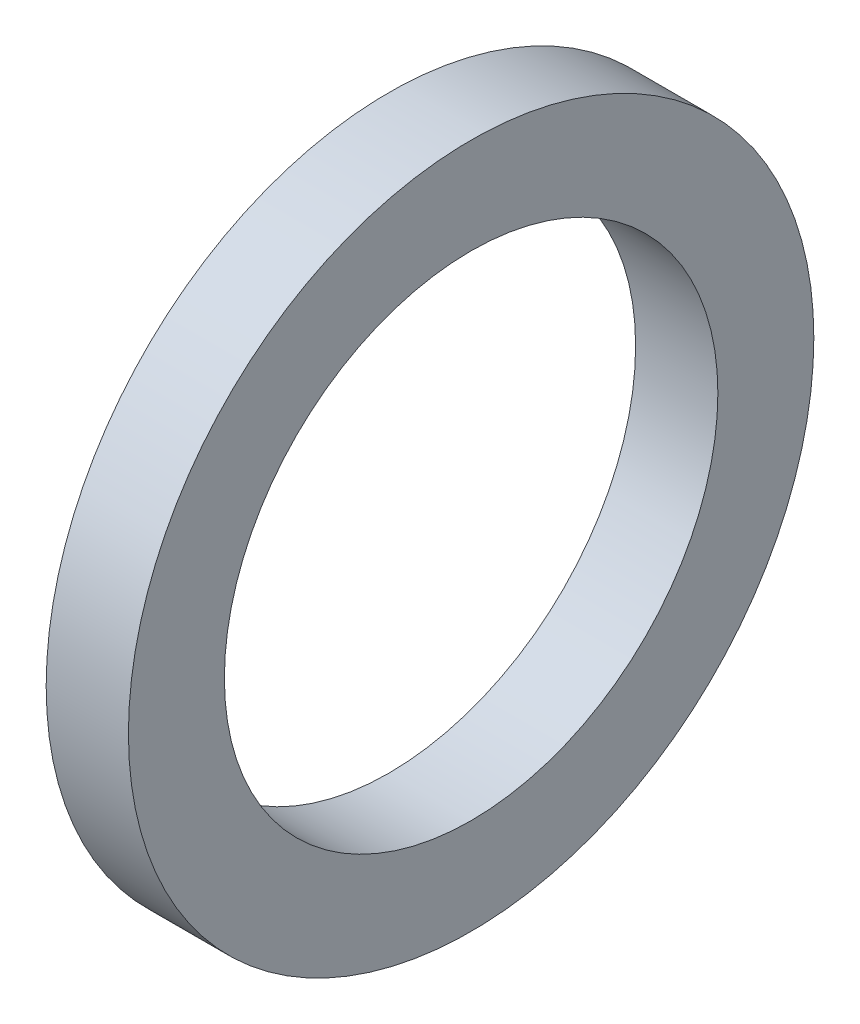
ISO-10303-21;
HEADER;
FILE_DESCRIPTION(('STEP AP214'),'2;1');
FILE_NAME('part.step','',(''),(''),'','','');
FILE_SCHEMA(('AUTOMOTIVE_DESIGN { 1 0 10303 214 1 1 1 1 }'));
ENDSEC;
DATA;
#1=APPLICATION_CONTEXT('core data for automotive mechanical design processes');
#2=APPLICATION_PROTOCOL_DEFINITION('international standard','automotive_design',2000,#1);
#3=PRODUCT_CONTEXT('',#1,'mechanical');
#4=PRODUCT('Part','Part','',(#3));
#5=PRODUCT_RELATED_PRODUCT_CATEGORY('part','',(#4));
#6=PRODUCT_DEFINITION_FORMATION('','',#4);
#7=PRODUCT_DEFINITION_CONTEXT('part definition',#1,'design');
#8=PRODUCT_DEFINITION('design','',#6,#7);
#9=PRODUCT_DEFINITION_SHAPE('','',#8);
#10=(LENGTH_UNIT() NAMED_UNIT(*) SI_UNIT(.MILLI.,.METRE.));
#11=(NAMED_UNIT(*) PLANE_ANGLE_UNIT() SI_UNIT($,.RADIAN.));
#12=(NAMED_UNIT(*) SI_UNIT($,.STERADIAN.) SOLID_ANGLE_UNIT());
#13=UNCERTAINTY_MEASURE_WITH_UNIT(LENGTH_MEASURE(1.E-05),#10,'distance_accuracy_value','');
#14=(GEOMETRIC_REPRESENTATION_CONTEXT(3) GLOBAL_UNCERTAINTY_ASSIGNED_CONTEXT((#13)) GLOBAL_UNIT_ASSIGNED_CONTEXT((#10,
#11,#12)) REPRESENTATION_CONTEXT('',''));
#15=CARTESIAN_POINT('',(0.,0.,0.));
#16=DIRECTION('',(0.,0.,1.));
#17=DIRECTION('',(1.,0.,0.));
#18=AXIS2_PLACEMENT_3D('',#15,#16,#17);
#19=CARTESIAN_POINT('',(-34.9249999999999,0.,0.));
#20=DIRECTION('',(-1.,0.,0.));
#21=DIRECTION('',(0.,0.,1.));
#22=AXIS2_PLACEMENT_3D('',#19,#20,#21);
#23=CYLINDRICAL_SURFACE('',#22,18.);
#24=CARTESIAN_POINT('',(0.,0.,0.));
#25=DIRECTION('',(-1.,0.,0.));
#26=DIRECTION('',(0.,0.,1.));
#27=AXIS2_PLACEMENT_3D('',#24,#25,#26);
#28=CIRCLE('',#27,18.);
#29=CARTESIAN_POINT('',(0.,0.,18.));
#30=VERTEX_POINT('',#29);
#31=EDGE_CURVE('E10',#30,#30,#28,.T.);
#32=ORIENTED_EDGE('',*,*,#31,.F.);
#33=EDGE_LOOP('',(#32));
#34=FACE_BOUND('',#33,.T.);
#35=CARTESIAN_POINT('',(-6.,0.,0.));
#36=DIRECTION('',(-1.,0.,0.));
#37=DIRECTION('',(0.,0.,1.));
#38=AXIS2_PLACEMENT_3D('',#35,#36,#37);
#39=CIRCLE('',#38,18.);
#40=CARTESIAN_POINT('',(-6.,0.,18.));
#41=VERTEX_POINT('',#40);
#42=EDGE_CURVE('E45',#41,#41,#39,.T.);
#43=ORIENTED_EDGE('',*,*,#42,.T.);
#44=EDGE_LOOP('',(#43));
#45=FACE_BOUND('',#44,.T.);
#46=ADVANCED_FACE('F31',(#34,#45),#23,.F.);
#47=CARTESIAN_POINT('',(0.,18.,0.));
#48=DIRECTION('',(-1.,0.,0.));
#49=DIRECTION('',(0.,0.,1.));
#50=AXIS2_PLACEMENT_3D('',#47,#48,#49);
#51=PLANE('',#50);
#52=CARTESIAN_POINT('',(0.,0.,0.));
#53=DIRECTION('',(-1.,0.,0.));
#54=DIRECTION('',(0.,0.,1.));
#55=AXIS2_PLACEMENT_3D('',#52,#53,#54);
#56=CIRCLE('',#55,25.);
#57=CARTESIAN_POINT('',(0.,0.,25.));
#58=VERTEX_POINT('',#57);
#59=EDGE_CURVE('E37',#58,#58,#56,.T.);
#60=ORIENTED_EDGE('',*,*,#59,.F.);
#61=EDGE_LOOP('',(#60));
#62=FACE_BOUND('',#61,.T.);
#63=ORIENTED_EDGE('',*,*,#31,.T.);
#64=EDGE_LOOP('',(#63));
#65=FACE_BOUND('',#64,.T.);
#66=ADVANCED_FACE('F60',(#62,#65),#51,.F.);
#67=CARTESIAN_POINT('',(-34.9249999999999,0.,0.));
#68=DIRECTION('',(-1.,0.,0.));
#69=DIRECTION('',(0.,0.,1.));
#70=AXIS2_PLACEMENT_3D('',#67,#68,#69);
#71=CYLINDRICAL_SURFACE('',#70,25.);
#72=CARTESIAN_POINT('',(-6.,0.,0.));
#73=DIRECTION('',(-1.,0.,0.));
#74=DIRECTION('',(0.,0.,1.));
#75=AXIS2_PLACEMENT_3D('',#72,#73,#74);
#76=CIRCLE('',#75,25.);
#77=CARTESIAN_POINT('',(-6.,0.,25.));
#78=VERTEX_POINT('',#77);
#79=EDGE_CURVE('E41',#78,#78,#76,.T.);
#80=ORIENTED_EDGE('',*,*,#79,.F.);
#81=EDGE_LOOP('',(#80));
#82=FACE_BOUND('',#81,.T.);
#83=ORIENTED_EDGE('',*,*,#59,.T.);
#84=EDGE_LOOP('',(#83));
#85=FACE_BOUND('',#84,.T.);
#86=ADVANCED_FACE('F55',(#82,#85),#71,.T.);
#87=CARTESIAN_POINT('',(-6.,25.,0.));
#88=DIRECTION('',(1.,0.,0.));
#89=DIRECTION('',(0.,0.,-1.));
#90=AXIS2_PLACEMENT_3D('',#87,#88,#89);
#91=PLANE('',#90);
#92=ORIENTED_EDGE('',*,*,#42,.F.);
#93=EDGE_LOOP('',(#92));
#94=FACE_BOUND('',#93,.T.);
#95=ORIENTED_EDGE('',*,*,#79,.T.);
#96=EDGE_LOOP('',(#95));
#97=FACE_BOUND('',#96,.T.);
#98=ADVANCED_FACE('F52',(#94,#97),#91,.F.);
#99=CLOSED_SHELL('',(#46,#66,#86,#98));
#100=MANIFOLD_SOLID_BREP('B2',#99);
#101=ADVANCED_BREP_SHAPE_REPRESENTATION('',(#18,#100),#14);
#102=SHAPE_DEFINITION_REPRESENTATION(#9,#101);
ENDSEC;
END-ISO-10303-21;
